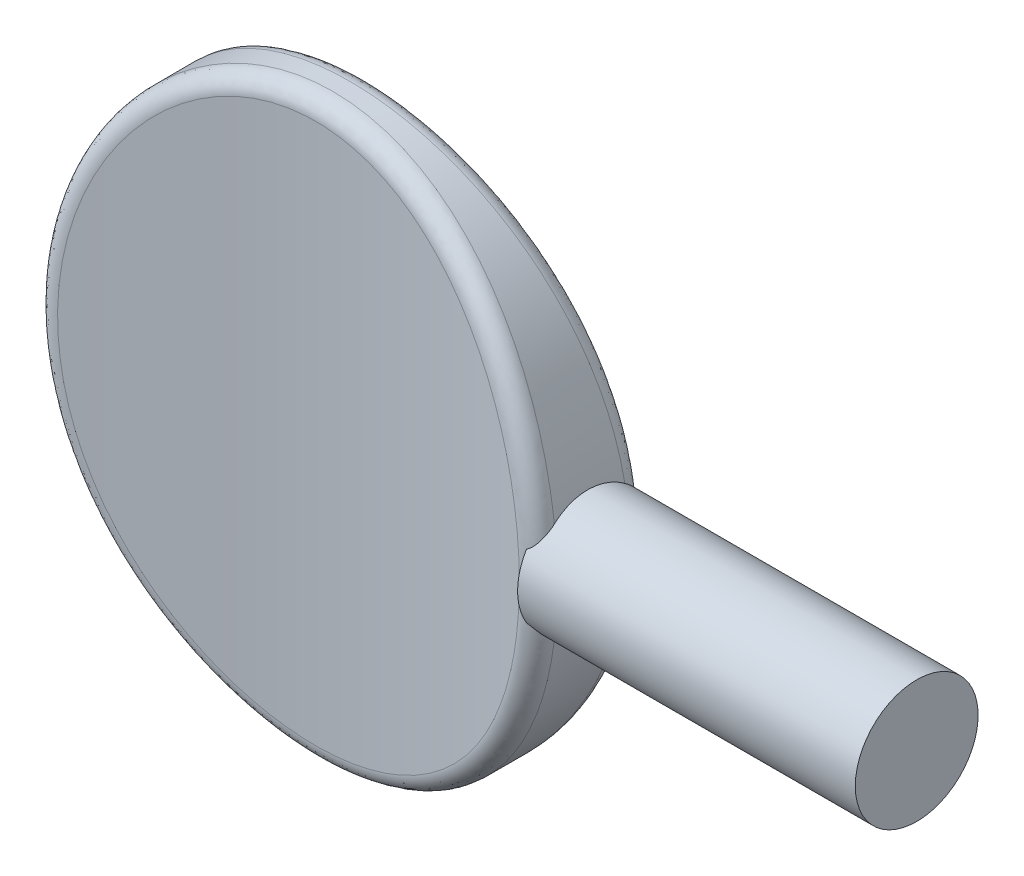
from build123d import *

# Parameters (mm, degrees)
SKETCH1_RX              = 11.303
SKETCH1_RY              = 9.906
EXTRUDE1_DEPTH          = 2.286
CUT_EXTRUDE1_DEPTH      = 16.202382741
CUT_EXTRUDE1_DEPTH_BACK = 16.202382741
SKETCH2_OUTSIDE_W       = 27.892
SKETCH2_OUTSIDE_H       = 12.652
FILLET3_R               = 0.677333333


with BuildPart() as part:
    # Sketch1 → Extrude1 (new, symmetric)
    with BuildSketch(Plane.XY):
        with Locations(Location((0, 0), (0, 0, -90))):
            Ellipse(SKETCH1_RX, SKETCH1_RY)
    extrude(amount=EXTRUDE1_DEPTH, both=True)

    # Sketch2 outside → Cut-Extrude1 (cut, two sides: drawn at the far end of the back side and taken through both)
    with BuildSketch(Plane(origin=(0, 0, 0), x_dir=(1, 0, 0), z_dir=(0, 1, 0)).offset(-CUT_EXTRUDE1_DEPTH_BACK)):
        Rectangle(SKETCH2_OUTSIDE_W, SKETCH2_OUTSIDE_H)
        with BuildLine():
            Line((-9.906, 2.286), (-9.906, -2.286))
            ThreePointArc((-9.906, -2.286), (0, -1.016), (9.906, -2.286))
            Line((9.906, -2.286), (9.906, 2.286))
            ThreePointArc((9.906, 2.286), (0, 1.016), (-9.906, 2.286))
        make_face(mode=Mode.SUBTRACT)
    extrude(amount=CUT_EXTRUDE1_DEPTH + CUT_EXTRUDE1_DEPTH_BACK, mode=Mode.SUBTRACT)

    # Fillet3
    fillet3_edges = [part.edges().sort_by_distance(p)[0] for p in [
        (-7.228513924, -7.728494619, 1.687044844),
        (3.75e-07, 11.303, -1.016),
    ]]
    fillet(fillet3_edges, radius=FILLET3_R)

    # Sketch3 → Revolve1 (revolve)
    with BuildSketch(Plane(origin=(0, 0, 0), x_dir=(1, 0, 0), z_dir=(0, 1, 0)), mode=Mode.PRIVATE) as revolve1_sk:
        with BuildLine():
            Line((13.208, 2.413), (22.606, 2.413))
            Line((22.606, 2.413), (22.606, 0))
            Line((22.606, 0), (9.072182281, 0))
            Line((9.072182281, 0), (9.072182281, 2.078343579))
            ThreePointArc((9.072182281, 2.078343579), (9.262571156, 2.199720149), (9.336678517, 2.413))
            Line((9.336678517, 2.413), (13.208, 2.413))
        make_face()
    revolve(revolve1_sk.sketch.rotate(Axis((0, 0, 0), (1, 0, 0)), 180), axis=Axis((0, 0, 0), (1, 0, 0)))


solid = part.part
